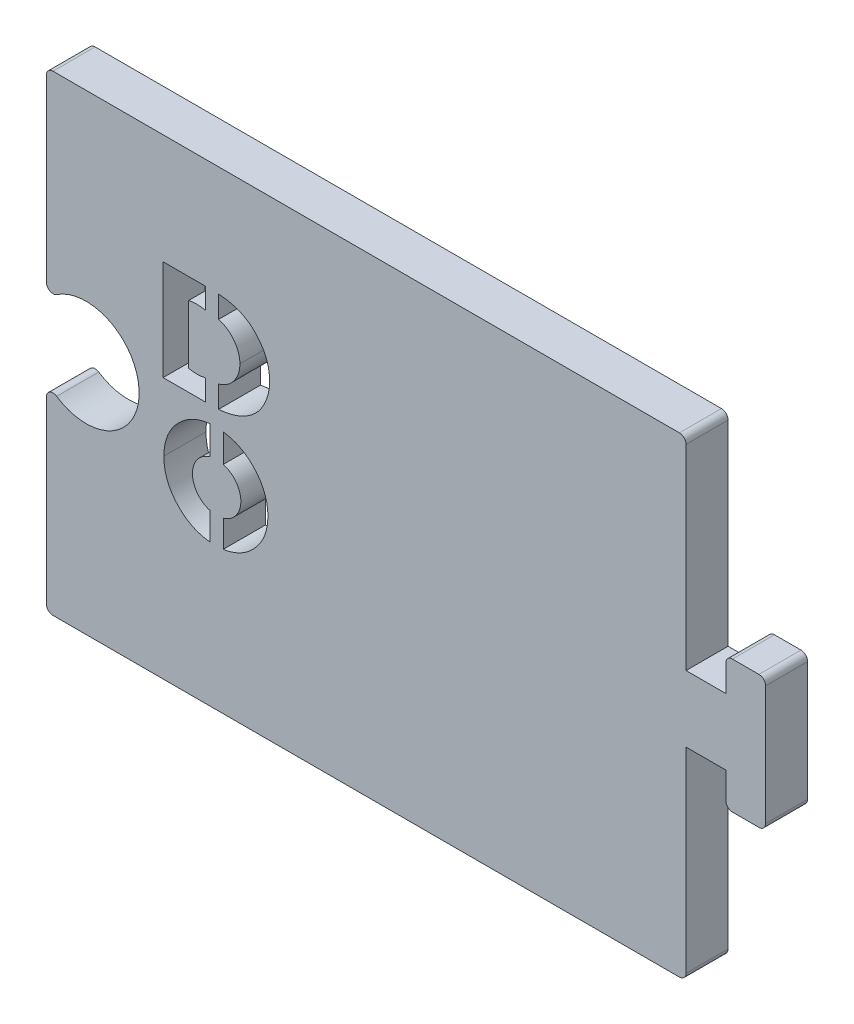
from build123d import *

# Parameters (mm, degrees)
BOSS_EXTRUDE1_DEPTH = 3.175
CUT_EXTRUDE10_START = 3.175
CUT_EXTRUDE10_DEPTH = 10
BOSS_EXTRUDE4_DEPTH = 3.175
FILLET1_R           = 0.5


with BuildPart() as part:
    # Sketch1 → Boss-Extrude1 (new body)
    with BuildSketch(Plane.XY):
        with BuildLine():
            Line((48.26, 35.56), (48.26, 20.28))
            Line((48.26, 20.28), (51.26, 20.28))
            Line((51.26, 20.28), (51.26, 22.78))
            Line((51.26, 22.78), (54.26, 22.78))
            Line((54.26, 22.78), (54.26, 12.78))
            Line((54.26, 12.78), (51.26, 12.78))
            Line((51.26, 12.78), (51.26, 15.28))
            Line((51.26, 15.28), (48.26, 15.28))
            Line((48.26, 15.28), (48.26, 0))
            Line((48.26, 0), (0, 0))
            Line((0, 0), (0, 15.134248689))
            ThreePointArc((0, 15.134248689), (7, 17.78), (0, 20.425751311))
            Line((0, 20.425751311), (0, 35.56))
            Line((0, 35.56), (48.26, 35.56))
        make_face()
    extrude(amount=BOSS_EXTRUDE1_DEPTH)

    # Sketch11 → Cut-Extrude10 (cut)
    # profile 1 of 2: a face of its own
    with BuildSketch(Plane.XY.offset(CUT_EXTRUDE10_START)):
        with BuildLine():
            Line((8.809753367, 27.263856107), (12.546221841, 27.263856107))
            add(Edge.make_bspline(
                [(12.546221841, 27.263856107), (12.631412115, 27.26302955), (12.799462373, 27.261399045), (13.04739161, 27.248066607), (13.287962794, 27.225989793), (13.521067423, 27.196343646), (13.746265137, 27.154366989), (13.964294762, 27.10693427), (14.174717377, 27.049680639), (14.37839815, 26.984654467), (14.573537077, 26.907657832), (14.762842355, 26.825864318), (14.942293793, 26.730551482), (15.116855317, 26.63130031), (15.281890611, 26.519349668), (15.439381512, 26.399439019), (15.591070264, 26.272413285), (15.779154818, 26.090343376), (15.995083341, 25.85162364), (16.223309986, 25.549732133), (16.415957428, 25.23441034), (16.572583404, 24.90532524), (16.696954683, 24.563939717), (16.781788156, 24.208163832), (16.836649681, 23.840588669), (16.84305935, 23.590857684), (16.846299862, 23.464602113)],
                knots=[0, 0, 0, 0, 0.951772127, 1.877509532, 2.773047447, 3.650573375, 4.501739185, 5.331620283, 6.142888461, 6.937380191, 7.719001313, 8.485918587, 9.239906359, 9.987928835, 10.728462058, 11.465853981, 12.199023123, 12.937456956, 14.388927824, 15.790819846, 17.159896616, 18.509821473, 19.856676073, 21.211193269, 22.590073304, 24, 24, 24, 24], degree=3))
            add(Edge.make_bspline(
                [(16.846299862, 23.464602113), (16.844992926, 23.383753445), (16.842381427, 23.222202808), (16.818303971, 22.981682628), (16.778836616, 22.743640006), (16.722878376, 22.508763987), (16.653073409, 22.275863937), (16.566248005, 22.045818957), (16.464042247, 21.818757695), (16.347927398, 21.595102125), (16.214980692, 21.379606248), (16.068148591, 21.17298999), (15.903943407, 20.98011288), (15.724350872, 20.799540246), (15.530551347, 20.630184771), (15.320473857, 20.473314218), (15.095140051, 20.329160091), (14.855804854, 20.195760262), (14.601971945, 20.077862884), (14.334873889, 19.97582339), (14.055884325, 19.887305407), (13.762712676, 19.818483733), (13.457269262, 19.762290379), (13.138797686, 19.72423774), (12.808034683, 19.69768993), (12.58326711, 19.695609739), (12.468835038, 19.694550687)],
                knots=[0, 0, 0, 0, 0.896736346, 1.791845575, 2.678642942, 3.571861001, 4.468662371, 5.374279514, 6.2975283, 7.229780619, 8.16789406, 9.104405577, 10.039140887, 10.974577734, 11.927492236, 12.891857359, 13.880393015, 14.893112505, 15.929451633, 16.982355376, 18.063363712, 19.173945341, 20.320958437, 21.507060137, 22.730812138, 24, 24, 24, 24], degree=3))
            Line((12.468835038, 19.694550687), (8.809753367, 19.694550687))
            Line((8.809753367, 19.694550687), (8.809753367, 27.263856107))
        make_face()
    # profile 2 of 2: a face of its own
    with BuildSketch(Plane.XY.offset(CUT_EXTRUDE10_START)):
        with BuildLine():
            add(Edge.make_bspline(
                [(12.74051755, 10.705862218), (12.607962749, 10.709159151), (12.346652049, 10.715658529), (11.962045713, 10.769277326), (11.593518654, 10.858516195), (11.239719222, 10.981387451), (10.902563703, 11.141989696), (10.580018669, 11.336852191), (10.273625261, 11.567615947), (9.986752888, 11.830697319), (9.724390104, 12.117935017), (9.495193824, 12.425460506), (9.299046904, 12.74727657), (9.14179849, 13.086892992), (9.015752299, 13.440323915), (8.92921427, 13.810622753), (8.874992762, 14.195903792), (8.868586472, 14.458209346), (8.865336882, 14.591263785)],
                knots=[0, 0, 0, 0, 1.040485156, 2.051150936, 3.042006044, 4.013743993, 4.986420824, 5.968868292, 6.967833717, 7.993026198, 9.021042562, 10.017717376, 11.000164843, 11.974671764, 12.951282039, 13.941245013, 14.955696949, 16, 16, 16, 16], degree=3))
            add(Edge.make_bspline(
                [(8.865336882, 14.591263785), (8.868646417, 14.723815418), (8.875170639, 14.985119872), (8.928543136, 15.369302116), (9.018266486, 15.737215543), (9.14078057, 16.090643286), (9.30138409, 16.427021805), (9.494645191, 16.749329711), (9.726138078, 17.053907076), (9.988620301, 17.340186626), (10.274563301, 17.603464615), (10.582051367, 17.832185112), (10.903515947, 18.02798301), (11.241936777, 18.185640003), (11.593942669, 18.311632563), (11.962781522, 18.398191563), (12.34661207, 18.452408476), (12.607949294, 18.458814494), (12.74051755, 18.462064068)],
                knots=[0, 0, 0, 0, 1.042650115, 2.055418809, 3.044613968, 4.018373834, 4.993074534, 5.972308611, 6.970293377, 7.997618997, 9.024944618, 10.023693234, 11.008184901, 11.981251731, 12.956283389, 13.944581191, 14.957349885, 16, 16, 16, 16], degree=3))
            add(Edge.make_bspline(
                [(12.74051755, 18.462064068), (12.87893085, 18.458963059), (13.151010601, 18.452867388), (13.549913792, 18.396923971), (13.93143875, 18.308385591), (14.296238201, 18.183785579), (14.643397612, 18.022273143), (14.974091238, 17.825726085), (15.285985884, 17.591887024), (15.577138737, 17.326169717), (15.84205772, 17.036506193), (16.076721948, 16.730048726), (16.273804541, 16.408327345), (16.436780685, 16.072841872), (16.560545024, 15.722308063), (16.649648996, 15.357983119), (16.705690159, 14.979450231), (16.711858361, 14.721897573), (16.714986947, 14.591263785)],
                knots=[0, 0, 0, 0, 1.074758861, 2.112659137, 3.122409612, 4.113641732, 5.101551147, 6.09171544, 7.096704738, 8.124480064, 9.149462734, 10.142373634, 11.118315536, 12.07546588, 13.034570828, 14.000204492, 14.985679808, 16, 16, 16, 16], degree=3))
            add(Edge.make_bspline(
                [(16.714986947, 14.591263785), (16.711863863, 14.460141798), (16.705706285, 14.201617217), (16.649581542, 13.821663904), (16.560901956, 13.456212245), (16.436070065, 13.104665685), (16.274299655, 12.767190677), (16.07668008, 12.443784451), (15.842131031, 12.135794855), (15.577110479, 11.844782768), (15.286445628, 11.577477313), (14.974054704, 11.343691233), (14.643733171, 11.147427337), (14.296702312, 10.985309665), (13.9321191, 10.85944005), (13.549892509, 10.771068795), (13.151016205, 10.715041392), (12.87893274, 10.708957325), (12.74051755, 10.705862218)],
                knots=[0, 0, 0, 0, 1.016130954, 2.003438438, 2.970871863, 3.928124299, 4.890229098, 5.867504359, 6.861503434, 7.887293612, 8.915628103, 9.918676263, 10.906928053, 11.889507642, 12.883621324, 13.891421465, 14.927317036, 16, 16, 16, 16], degree=3))
        make_face()
        with BuildLine():
            add(Edge.make_bspline(
                [(12.74051755, 15.471721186), (12.708589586, 15.469900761), (12.644532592, 15.466248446), (12.552102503, 15.431417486), (12.464360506, 15.377588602), (12.383274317, 15.303487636), (12.313367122, 15.209195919), (12.26392936, 15.094418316), (12.234799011, 14.961624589), (12.231314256, 14.867386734), (12.229472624, 14.817583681)],
                knots=[0, 0, 0, 0, 0.826159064, 1.657520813, 2.530942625, 3.488112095, 4.491546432, 5.555239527, 6.707986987, 8, 8, 8, 8], degree=3))
            add(Edge.make_bspline(
                [(12.229472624, 14.817583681), (12.23136785, 14.767794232), (12.234972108, 14.673106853), (12.263639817, 14.539684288), (12.313471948, 14.424610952), (12.382776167, 14.33015358), (12.464869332, 14.257659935), (12.552046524, 14.203688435), (12.644546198, 14.168933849), (12.708594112, 14.165271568), (12.74051755, 14.163446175)],
                knots=[0, 0, 0, 0, 1.291388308, 2.455905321, 3.519084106, 4.522033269, 5.47028112, 6.343280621, 7.174240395, 8, 8, 8, 8], degree=3))
            add(Edge.make_bspline(
                [(12.74051755, 14.163446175), (12.783113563, 14.165574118), (12.86643115, 14.169736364), (12.984563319, 14.2056201), (13.090493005, 14.264553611), (13.181594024, 14.345320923), (13.25870923, 14.443004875), (13.312222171, 14.557030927), (13.346172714, 14.683256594), (13.349249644, 14.771600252), (13.350851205, 14.817583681)],
                knots=[0, 0, 0, 0, 1.018881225, 1.992926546, 2.927422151, 3.902723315, 4.891802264, 5.88807411, 6.90072932, 8, 8, 8, 8], degree=3))
            add(Edge.make_bspline(
                [(13.350851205, 14.817583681), (13.349137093, 14.863054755), (13.345809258, 14.95133379), (13.312849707, 15.077390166), (13.258313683, 15.191060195), (13.181132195, 15.288279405), (13.090806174, 15.371248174), (12.983693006, 15.428757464), (12.866069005, 15.46572119), (12.783149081, 15.469683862), (12.74051755, 15.471721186)],
                knots=[0, 0, 0, 0, 1.088197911, 2.112663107, 3.098941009, 4.088526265, 5.072039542, 6.017223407, 6.980597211, 8, 8, 8, 8], degree=3))
        make_face(mode=Mode.SUBTRACT)
    extrude(amount=-CUT_EXTRUDE10_DEPTH, mode=Mode.SUBTRACT)

    # Sketch13 → Boss-Extrude4 (add)
    with BuildSketch(Plane.XY):
        with BuildLine():
            Line((10.737754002, 25.700181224), (10.737754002, 21.26001006))
            add(Edge.make_bspline(
                [(10.737754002, 21.26001006), (11.368504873, 21.129019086), (11.993648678, 21.272245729)],
                knots=[0, 0, 0, 1, 1, 1], degree=2))
            Line((11.993648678, 21.272245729), (11.993648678, 19.385515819))
            Line((11.993648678, 19.385515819), (12.993648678, 19.385515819))
            Line((12.993648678, 19.385515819), (12.993648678, 21.370131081))
            add(Edge.make_bspline(
                [(12.993648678, 21.370131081), (13.931192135, 21.607945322), (14.619451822, 22.535019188), (14.597675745, 23.480095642)],
                knots=[0, 0, 0, 0, 1, 1, 1, 1], degree=3))
            add(Edge.make_bspline(
                [(12.993648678, 25.590060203), (13.931192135, 25.352245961), (14.619451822, 24.425172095), (14.597675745, 23.480095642)],
                knots=[0, 0, 0, 0, 1, 1, 1, 1], degree=3))
            Line((12.993648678, 25.590060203), (12.993648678, 28.636127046))
            Line((12.993648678, 28.636127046), (11.993648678, 28.636127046))
            Line((11.993648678, 28.636127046), (11.993648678, 25.687945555))
            add(Edge.make_bspline(
                [(10.737754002, 25.700181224), (11.368504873, 25.831172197), (11.993648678, 25.687945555)],
                knots=[0, 0, 0, 1, 1, 1], degree=2))
        make_face()
        with BuildLine():
            Line((12.347166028, 18.832632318), (13.347166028, 18.832632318))
            Line((13.347166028, 18.832632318), (13.347166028, 16.291807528))
            ThreePointArc((13.347166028, 16.291807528), (14.672785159, 14.535943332), (13.347166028, 12.780079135))
            Line((13.347166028, 12.780079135), (13.347166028, 10.32398662))
            Line((13.347166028, 10.32398662), (12.347166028, 10.32398662))
            Line((12.347166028, 10.32398662), (12.347166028, 12.780041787))
            ThreePointArc((12.347166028, 12.780041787), (11.021415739, 14.535943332), (12.347166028, 16.291844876))
            Line((12.347166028, 16.291844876), (12.347166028, 18.832632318))
        make_face()
    extrude(amount=BOSS_EXTRUDE4_DEPTH)

    # Fillet1
    fillet1_edges = [part.edges().sort_by_distance(p)[0] for p in [
        (0, 15.134248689, 1.5875),
        (0, 0, 1.5875),
        (48.26, 0, 1.5875),
        (51.26, 12.78, 1.5875),
        (54.26, 12.78, 1.5875),
        (54.26, 22.78, 1.5875),
        (51.26, 22.78, 1.5875),
        (48.26, 35.56, 1.5875),
        (0, 35.56, 1.5875),
        (0, 20.425751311, 1.5875),
    ]]
    fillet(fillet1_edges, radius=FILLET1_R)


solid = part.part
